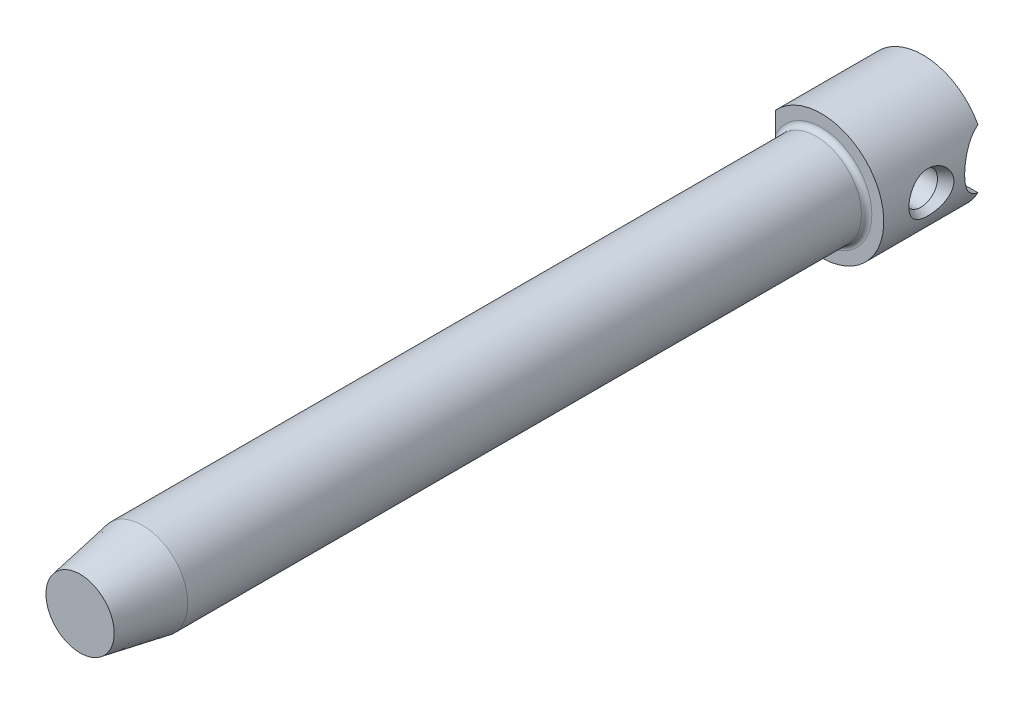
from build123d import *

# Parameters (mm, degrees)
CUT_EXTRUDE_1_DEPTH = 65.645565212
CUT_EXTRUDE_2_DEPTH = 61.927193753


with BuildPart() as part:
    # Sketch 1 → Revolve 1 (revolve)
    with BuildSketch(Plane(origin=(0, 0, 0), x_dir=(0, 0, -1), z_dir=(1, 0, 0)), mode=Mode.PRIVATE) as revolve_1_sk:
        with BuildLine():
            Line((-60.17895, 0), (-60.17895, 2.6035))
            Line((-60.17895, 2.6035), (-55.41645, 3.4544))
            Line((-55.41645, 3.4544), (-4.029075, 3.4544))
            ThreePointArc((-4.029075, 3.4544), (-3.748441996, 3.570641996), (-3.6322, 3.851275))
            Line((-3.6322, 3.851275), (-3.6322, 4.7625))
            Line((-3.6322, 4.7625), (4.1148, 4.7625))
            Line((4.1148, 4.7625), (4.1148, 0))
            Line((4.1148, 0), (-60.17895, 0))
        make_face()
    revolve(revolve_1_sk.sketch.rotate(Axis((0, 0, 60.17895), (0, 0, -1)), 90), axis=Axis((0, 0, 60.17895), (0, 0, -1)))

    # Sketch 2 → Cut-Extrude 1 (cut, through all)
    with BuildSketch(Plane(origin=(0, 0, -4.1148), x_dir=(-1, 0, 0), z_dir=(0, 0, -1))):
        with BuildLine():
            Line((3.4798, 3.251522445), (3.4798, -3.251522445))
            ThreePointArc((3.4798, -3.251522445), (4.7625, 0), (3.4798, 3.251522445))
        make_face()
    extrude(amount=-CUT_EXTRUDE_1_DEPTH, mode=Mode.SUBTRACT)

    # Sketch 3 → Cut-Extrude 2 (cut, through all)
    with BuildSketch(Plane.ZY.offset(3.4798)):
        with BuildLine():
            Line((-4.1148, 2.24053341), (-4.1148, -2.24053341))
            ThreePointArc((-4.1148, -2.24053341), (-2.54, 0), (-4.1148, 2.24053341))
        make_face()
    extrude(amount=-CUT_EXTRUDE_2_DEPTH, mode=Mode.SUBTRACT)

    # Sketch 4 → Cut-Revolve 1 (revolve, cut)
    with BuildSketch(Plane(origin=(0, 0, 0), x_dir=(1, 0, 0), z_dir=(0, 1, 0))):
        Polygon((-3.4798, -1.715571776), (-3.4798, 0), (4.7625, 0), (4.7625, -1.715571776), (3.96875, -1.2573), (-2.68605, -1.2573), align=None)
    revolve(axis=Axis((-4.440985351, 0, 0), (1, 0, 0)), mode=Mode.SUBTRACT)


solid = part.part
